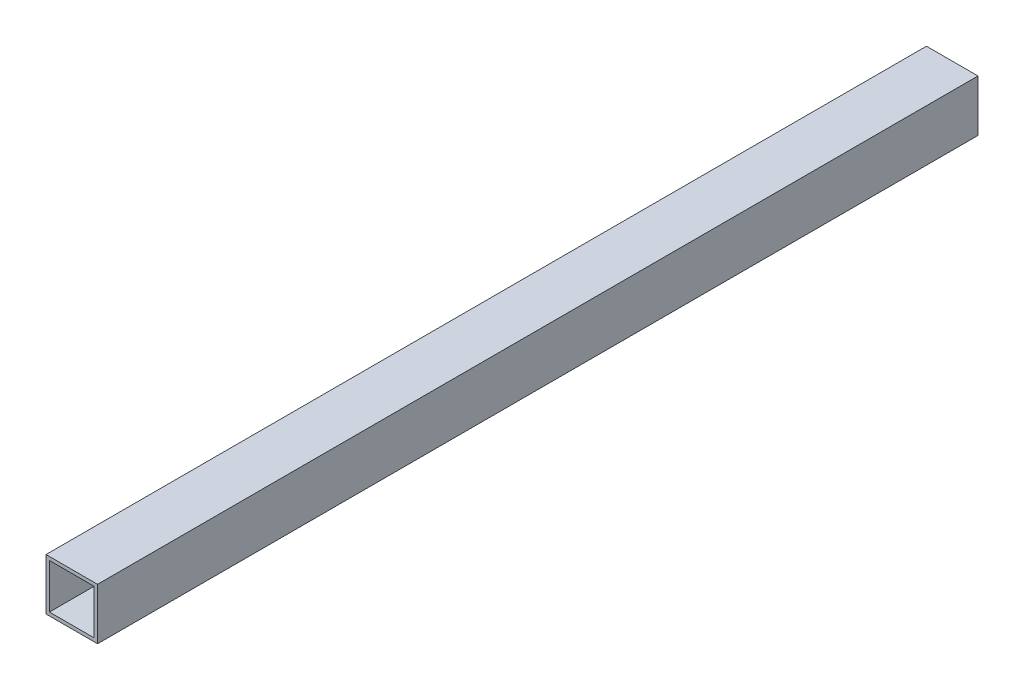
ISO-10303-21;
HEADER;
FILE_DESCRIPTION(('STEP AP214'),'2;1');
FILE_NAME('part.step','',(''),(''),'','','');
FILE_SCHEMA(('AUTOMOTIVE_DESIGN { 1 0 10303 214 1 1 1 1 }'));
ENDSEC;
DATA;
#1=APPLICATION_CONTEXT('core data for automotive mechanical design processes');
#2=APPLICATION_PROTOCOL_DEFINITION('international standard','automotive_design',2000,#1);
#3=PRODUCT_CONTEXT('',#1,'mechanical');
#4=PRODUCT('Part','Part','',(#3));
#5=PRODUCT_RELATED_PRODUCT_CATEGORY('part','',(#4));
#6=PRODUCT_DEFINITION_FORMATION('','',#4);
#7=PRODUCT_DEFINITION_CONTEXT('part definition',#1,'design');
#8=PRODUCT_DEFINITION('design','',#6,#7);
#9=PRODUCT_DEFINITION_SHAPE('','',#8);
#10=(LENGTH_UNIT() NAMED_UNIT(*) SI_UNIT(.MILLI.,.METRE.));
#11=(NAMED_UNIT(*) PLANE_ANGLE_UNIT() SI_UNIT($,.RADIAN.));
#12=(NAMED_UNIT(*) SI_UNIT($,.STERADIAN.) SOLID_ANGLE_UNIT());
#13=UNCERTAINTY_MEASURE_WITH_UNIT(LENGTH_MEASURE(1.E-05),#10,'distance_accuracy_value','');
#14=(GEOMETRIC_REPRESENTATION_CONTEXT(3) GLOBAL_UNCERTAINTY_ASSIGNED_CONTEXT((#13)) GLOBAL_UNIT_ASSIGNED_CONTEXT((#10,
#11,#12)) REPRESENTATION_CONTEXT('',''));
#15=CARTESIAN_POINT('',(0.,0.,0.));
#16=DIRECTION('',(0.,0.,1.));
#17=DIRECTION('',(1.,0.,0.));
#18=AXIS2_PLACEMENT_3D('',#15,#16,#17);
#19=CARTESIAN_POINT('',(0.,0.,2050.));
#20=DIRECTION('',(0.,0.,1.));
#21=DIRECTION('',(1.,0.,0.));
#22=AXIS2_PLACEMENT_3D('',#19,#20,#21);
#23=PLANE('',#22);
#24=DIRECTION('',(0.,-1.,0.));
#25=VECTOR('',#24,1.);
#26=CARTESIAN_POINT('',(-52.,52.,2050.));
#27=LINE('',#26,#25);
#28=CARTESIAN_POINT('',(-52.,52.,2050.));
#29=VERTEX_POINT('',#28);
#30=CARTESIAN_POINT('',(-52.,-52.,2050.));
#31=VERTEX_POINT('',#30);
#32=EDGE_CURVE('E25',#29,#31,#27,.T.);
#33=ORIENTED_EDGE('',*,*,#32,.F.);
#34=DIRECTION('',(-1.,0.,0.));
#35=VECTOR('',#34,1.);
#36=CARTESIAN_POINT('',(52.,52.,2050.));
#37=LINE('',#36,#35);
#38=CARTESIAN_POINT('',(52.,52.,2050.));
#39=VERTEX_POINT('',#38);
#40=EDGE_CURVE('E84',#39,#29,#37,.T.);
#41=ORIENTED_EDGE('',*,*,#40,.F.);
#42=DIRECTION('',(0.,1.,0.));
#43=VECTOR('',#42,1.);
#44=CARTESIAN_POINT('',(52.,-52.,2050.));
#45=LINE('',#44,#43);
#46=CARTESIAN_POINT('',(52.,-52.,2050.));
#47=VERTEX_POINT('',#46);
#48=EDGE_CURVE('E146',#47,#39,#45,.T.);
#49=ORIENTED_EDGE('',*,*,#48,.F.);
#50=DIRECTION('',(1.,0.,0.));
#51=VECTOR('',#50,1.);
#52=CARTESIAN_POINT('',(-52.,-52.,2050.));
#53=LINE('',#52,#51);
#54=EDGE_CURVE('E175',#31,#47,#53,.T.);
#55=ORIENTED_EDGE('',*,*,#54,.F.);
#56=EDGE_LOOP('',(#33,#41,#49,#55));
#57=FACE_BOUND('',#56,.T.);
#58=DIRECTION('',(1.,0.,0.));
#59=VECTOR('',#58,1.);
#60=CARTESIAN_POINT('',(-60.,-60.,2050.));
#61=LINE('',#60,#59);
#62=CARTESIAN_POINT('',(-60.,-60.,2050.));
#63=VERTEX_POINT('',#62);
#64=CARTESIAN_POINT('',(60.,-60.,2050.));
#65=VERTEX_POINT('',#64);
#66=EDGE_CURVE('E170',#63,#65,#61,.T.);
#67=ORIENTED_EDGE('',*,*,#66,.T.);
#68=DIRECTION('',(0.,1.,0.));
#69=VECTOR('',#68,1.);
#70=CARTESIAN_POINT('',(60.,-60.,2050.));
#71=LINE('',#70,#69);
#72=CARTESIAN_POINT('',(60.,60.,2050.));
#73=VERTEX_POINT('',#72);
#74=EDGE_CURVE('E129',#65,#73,#71,.T.);
#75=ORIENTED_EDGE('',*,*,#74,.T.);
#76=DIRECTION('',(-1.,0.,0.));
#77=VECTOR('',#76,1.);
#78=CARTESIAN_POINT('',(60.,60.,2050.));
#79=LINE('',#78,#77);
#80=CARTESIAN_POINT('',(-60.,60.,2050.));
#81=VERTEX_POINT('',#80);
#82=EDGE_CURVE('E128',#73,#81,#79,.T.);
#83=ORIENTED_EDGE('',*,*,#82,.T.);
#84=DIRECTION('',(0.,-1.,0.));
#85=VECTOR('',#84,1.);
#86=CARTESIAN_POINT('',(-60.,60.,2050.));
#87=LINE('',#86,#85);
#88=EDGE_CURVE('E111',#81,#63,#87,.T.);
#89=ORIENTED_EDGE('',*,*,#88,.T.);
#90=EDGE_LOOP('',(#67,#75,#83,#89));
#91=FACE_BOUND('',#90,.T.);
#92=ADVANCED_FACE('F16',(#57,#91),#23,.T.);
#93=CARTESIAN_POINT('',(0.,0.,0.));
#94=DIRECTION('',(0.,0.,1.));
#95=DIRECTION('',(1.,0.,0.));
#96=AXIS2_PLACEMENT_3D('',#93,#94,#95);
#97=PLANE('',#96);
#98=DIRECTION('',(1.,0.,0.));
#99=VECTOR('',#98,1.);
#100=CARTESIAN_POINT('',(-52.,-52.,0.));
#101=LINE('',#100,#99);
#102=CARTESIAN_POINT('',(-52.,-52.,0.));
#103=VERTEX_POINT('',#102);
#104=CARTESIAN_POINT('',(52.,-52.,0.));
#105=VERTEX_POINT('',#104);
#106=EDGE_CURVE('E151',#103,#105,#101,.T.);
#107=ORIENTED_EDGE('',*,*,#106,.T.);
#108=DIRECTION('',(0.,1.,0.));
#109=VECTOR('',#108,1.);
#110=CARTESIAN_POINT('',(52.,-52.,0.));
#111=LINE('',#110,#109);
#112=CARTESIAN_POINT('',(52.,52.,0.));
#113=VERTEX_POINT('',#112);
#114=EDGE_CURVE('E77',#105,#113,#111,.T.);
#115=ORIENTED_EDGE('',*,*,#114,.T.);
#116=DIRECTION('',(-1.,0.,0.));
#117=VECTOR('',#116,1.);
#118=CARTESIAN_POINT('',(52.,52.,0.));
#119=LINE('',#118,#117);
#120=CARTESIAN_POINT('',(-52.,52.,0.));
#121=VERTEX_POINT('',#120);
#122=EDGE_CURVE('E94',#113,#121,#119,.T.);
#123=ORIENTED_EDGE('',*,*,#122,.T.);
#124=DIRECTION('',(0.,-1.,0.));
#125=VECTOR('',#124,1.);
#126=CARTESIAN_POINT('',(-52.,52.,0.));
#127=LINE('',#126,#125);
#128=EDGE_CURVE('E10',#121,#103,#127,.T.);
#129=ORIENTED_EDGE('',*,*,#128,.T.);
#130=EDGE_LOOP('',(#107,#115,#123,#129));
#131=FACE_BOUND('',#130,.T.);
#132=DIRECTION('',(0.,-1.,0.));
#133=VECTOR('',#132,1.);
#134=CARTESIAN_POINT('',(-60.,60.,0.));
#135=LINE('',#134,#133);
#136=CARTESIAN_POINT('',(-60.,60.,0.));
#137=VERTEX_POINT('',#136);
#138=CARTESIAN_POINT('',(-60.,-60.,0.));
#139=VERTEX_POINT('',#138);
#140=EDGE_CURVE('E125',#137,#139,#135,.T.);
#141=ORIENTED_EDGE('',*,*,#140,.F.);
#142=DIRECTION('',(-1.,0.,0.));
#143=VECTOR('',#142,1.);
#144=CARTESIAN_POINT('',(60.,60.,0.));
#145=LINE('',#144,#143);
#146=CARTESIAN_POINT('',(60.,60.,0.));
#147=VERTEX_POINT('',#146);
#148=EDGE_CURVE('E136',#147,#137,#145,.T.);
#149=ORIENTED_EDGE('',*,*,#148,.F.);
#150=DIRECTION('',(0.,1.,0.));
#151=VECTOR('',#150,1.);
#152=CARTESIAN_POINT('',(60.,-60.,0.));
#153=LINE('',#152,#151);
#154=CARTESIAN_POINT('',(60.,-60.,0.));
#155=VERTEX_POINT('',#154);
#156=EDGE_CURVE('E180',#155,#147,#153,.T.);
#157=ORIENTED_EDGE('',*,*,#156,.F.);
#158=DIRECTION('',(1.,0.,0.));
#159=VECTOR('',#158,1.);
#160=CARTESIAN_POINT('',(-60.,-60.,0.));
#161=LINE('',#160,#159);
#162=EDGE_CURVE('E171',#139,#155,#161,.T.);
#163=ORIENTED_EDGE('',*,*,#162,.F.);
#164=EDGE_LOOP('',(#141,#149,#157,#163));
#165=FACE_BOUND('',#164,.T.);
#166=ADVANCED_FACE('F213',(#131,#165),#97,.F.);
#167=CARTESIAN_POINT('',(-52.,52.,0.));
#168=DIRECTION('',(1.,0.,0.));
#169=DIRECTION('',(0.,1.,0.));
#170=AXIS2_PLACEMENT_3D('',#167,#168,#169);
#171=PLANE('',#170);
#172=DIRECTION('',(0.,0.,1.));
#173=VECTOR('',#172,1.);
#174=CARTESIAN_POINT('',(-52.,52.,0.));
#175=LINE('',#174,#173);
#176=EDGE_CURVE('E155',#121,#29,#175,.T.);
#177=ORIENTED_EDGE('',*,*,#176,.T.);
#178=ORIENTED_EDGE('',*,*,#32,.T.);
#179=DIRECTION('',(0.,0.,1.));
#180=VECTOR('',#179,1.);
#181=CARTESIAN_POINT('',(-52.,-52.,0.));
#182=LINE('',#181,#180);
#183=EDGE_CURVE('E124',#103,#31,#182,.T.);
#184=ORIENTED_EDGE('',*,*,#183,.F.);
#185=ORIENTED_EDGE('',*,*,#128,.F.);
#186=EDGE_LOOP('',(#177,#178,#184,#185));
#187=FACE_BOUND('',#186,.T.);
#188=ADVANCED_FACE('F238',(#187),#171,.T.);
#189=CARTESIAN_POINT('',(52.,52.,0.));
#190=DIRECTION('',(0.,-1.,0.));
#191=DIRECTION('',(0.,0.,-1.));
#192=AXIS2_PLACEMENT_3D('',#189,#190,#191);
#193=PLANE('',#192);
#194=DIRECTION('',(0.,0.,1.));
#195=VECTOR('',#194,1.);
#196=CARTESIAN_POINT('',(52.,52.,0.));
#197=LINE('',#196,#195);
#198=EDGE_CURVE('E150',#113,#39,#197,.T.);
#199=ORIENTED_EDGE('',*,*,#198,.T.);
#200=ORIENTED_EDGE('',*,*,#40,.T.);
#201=ORIENTED_EDGE('',*,*,#176,.F.);
#202=ORIENTED_EDGE('',*,*,#122,.F.);
#203=EDGE_LOOP('',(#199,#200,#201,#202));
#204=FACE_BOUND('',#203,.T.);
#205=ADVANCED_FACE('F230',(#204),#193,.T.);
#206=CARTESIAN_POINT('',(52.,-52.,0.));
#207=DIRECTION('',(-1.,0.,0.));
#208=DIRECTION('',(0.,0.,1.));
#209=AXIS2_PLACEMENT_3D('',#206,#207,#208);
#210=PLANE('',#209);
#211=DIRECTION('',(0.,0.,1.));
#212=VECTOR('',#211,1.);
#213=CARTESIAN_POINT('',(52.,-52.,0.));
#214=LINE('',#213,#212);
#215=EDGE_CURVE('E181',#105,#47,#214,.T.);
#216=ORIENTED_EDGE('',*,*,#215,.T.);
#217=ORIENTED_EDGE('',*,*,#48,.T.);
#218=ORIENTED_EDGE('',*,*,#198,.F.);
#219=ORIENTED_EDGE('',*,*,#114,.F.);
#220=EDGE_LOOP('',(#216,#217,#218,#219));
#221=FACE_BOUND('',#220,.T.);
#222=ADVANCED_FACE('F228',(#221),#210,.T.);
#223=CARTESIAN_POINT('',(-52.,-52.,0.));
#224=DIRECTION('',(0.,1.,0.));
#225=DIRECTION('',(1.,0.,0.));
#226=AXIS2_PLACEMENT_3D('',#223,#224,#225);
#227=PLANE('',#226);
#228=ORIENTED_EDGE('',*,*,#183,.T.);
#229=ORIENTED_EDGE('',*,*,#54,.T.);
#230=ORIENTED_EDGE('',*,*,#215,.F.);
#231=ORIENTED_EDGE('',*,*,#106,.F.);
#232=EDGE_LOOP('',(#228,#229,#230,#231));
#233=FACE_BOUND('',#232,.T.);
#234=ADVANCED_FACE('F226',(#233),#227,.T.);
#235=CARTESIAN_POINT('',(-60.,60.,0.));
#236=DIRECTION('',(1.,0.,0.));
#237=DIRECTION('',(0.,1.,0.));
#238=AXIS2_PLACEMENT_3D('',#235,#236,#237);
#239=PLANE('',#238);
#240=ORIENTED_EDGE('',*,*,#140,.T.);
#241=DIRECTION('',(0.,0.,1.));
#242=VECTOR('',#241,1.);
#243=CARTESIAN_POINT('',(-60.,-60.,0.));
#244=LINE('',#243,#242);
#245=EDGE_CURVE('E119',#139,#63,#244,.T.);
#246=ORIENTED_EDGE('',*,*,#245,.T.);
#247=ORIENTED_EDGE('',*,*,#88,.F.);
#248=DIRECTION('',(0.,0.,1.));
#249=VECTOR('',#248,1.);
#250=CARTESIAN_POINT('',(-60.,60.,0.));
#251=LINE('',#250,#249);
#252=EDGE_CURVE('E116',#137,#81,#251,.T.);
#253=ORIENTED_EDGE('',*,*,#252,.F.);
#254=EDGE_LOOP('',(#240,#246,#247,#253));
#255=FACE_BOUND('',#254,.T.);
#256=ADVANCED_FACE('F114',(#255),#239,.F.);
#257=CARTESIAN_POINT('',(60.,60.,0.));
#258=DIRECTION('',(0.,-1.,0.));
#259=DIRECTION('',(0.,0.,-1.));
#260=AXIS2_PLACEMENT_3D('',#257,#258,#259);
#261=PLANE('',#260);
#262=ORIENTED_EDGE('',*,*,#148,.T.);
#263=ORIENTED_EDGE('',*,*,#252,.T.);
#264=ORIENTED_EDGE('',*,*,#82,.F.);
#265=DIRECTION('',(0.,0.,1.));
#266=VECTOR('',#265,1.);
#267=CARTESIAN_POINT('',(60.,60.,0.));
#268=LINE('',#267,#266);
#269=EDGE_CURVE('E187',#147,#73,#268,.T.);
#270=ORIENTED_EDGE('',*,*,#269,.F.);
#271=EDGE_LOOP('',(#262,#263,#264,#270));
#272=FACE_BOUND('',#271,.T.);
#273=ADVANCED_FACE('F135',(#272),#261,.F.);
#274=CARTESIAN_POINT('',(60.,-60.,0.));
#275=DIRECTION('',(-1.,0.,0.));
#276=DIRECTION('',(0.,0.,1.));
#277=AXIS2_PLACEMENT_3D('',#274,#275,#276);
#278=PLANE('',#277);
#279=ORIENTED_EDGE('',*,*,#156,.T.);
#280=ORIENTED_EDGE('',*,*,#269,.T.);
#281=ORIENTED_EDGE('',*,*,#74,.F.);
#282=DIRECTION('',(0.,0.,1.));
#283=VECTOR('',#282,1.);
#284=CARTESIAN_POINT('',(60.,-60.,0.));
#285=LINE('',#284,#283);
#286=EDGE_CURVE('E167',#155,#65,#285,.T.);
#287=ORIENTED_EDGE('',*,*,#286,.F.);
#288=EDGE_LOOP('',(#279,#280,#281,#287));
#289=FACE_BOUND('',#288,.T.);
#290=ADVANCED_FACE('F208',(#289),#278,.F.);
#291=CARTESIAN_POINT('',(-60.,-60.,0.));
#292=DIRECTION('',(0.,1.,0.));
#293=DIRECTION('',(1.,0.,0.));
#294=AXIS2_PLACEMENT_3D('',#291,#292,#293);
#295=PLANE('',#294);
#296=ORIENTED_EDGE('',*,*,#162,.T.);
#297=ORIENTED_EDGE('',*,*,#286,.T.);
#298=ORIENTED_EDGE('',*,*,#66,.F.);
#299=ORIENTED_EDGE('',*,*,#245,.F.);
#300=EDGE_LOOP('',(#296,#297,#298,#299));
#301=FACE_BOUND('',#300,.T.);
#302=ADVANCED_FACE('F215',(#301),#295,.F.);
#303=CLOSED_SHELL('',(#92,#166,#188,#205,#222,#234,#256,#273,#290,#302));
#304=MANIFOLD_SOLID_BREP('B1',#303);
#305=ADVANCED_BREP_SHAPE_REPRESENTATION('',(#18,#304),#14);
#306=SHAPE_DEFINITION_REPRESENTATION(#9,#305);
ENDSEC;
END-ISO-10303-21;
